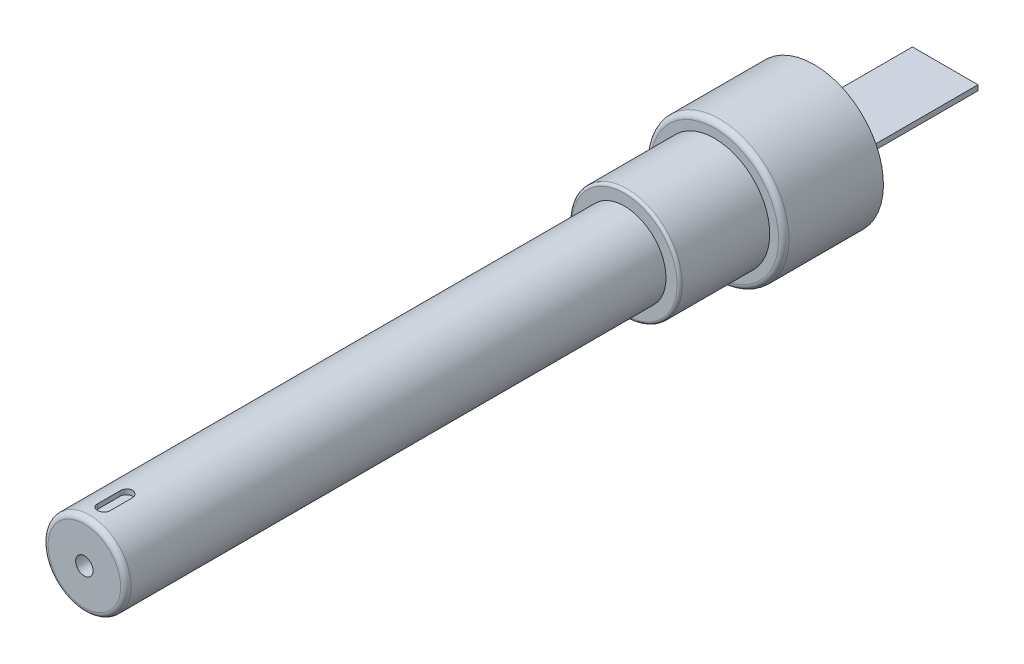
from build123d import *

# Parameters (mm, degrees)
ISFET_DEPTH = 0.762
SKETCH6_W   = 9.525
SKETCH6_H   = 0.762
PCB_DEPTH   = 25.4


with BuildPart() as part:
    # Sketch1 → sensor body (revolve)
    with BuildSketch(Plane(origin=(0, 0, 0), x_dir=(0, 0, -1), z_dir=(1, 0, 0)), mode=Mode.PRIVATE) as sensor_body_sk:
        with BuildLine():
            Line((0, 1.27), (9.525, 1.27))
            Line((9.525, 1.27), (9.525, 5.5245))
            Line((9.525, 5.5245), (78.486, 5.5245))
            Line((78.486, 5.5245), (78.486, 6.0325))
            Line((78.486, 6.0325), (0.762, 6.0325))
            ThreePointArc((0.762, 6.0325), (0.223184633, 5.809315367), (0, 5.2705))
            Line((0, 5.2705), (0, 1.27))
        make_face()
    revolve(sensor_body_sk.sketch.rotate(Axis((0, 0, 0), (0, 0, -1)), 90), axis=Axis((0, 0, 0), (0, 0, -1)))

    # Sketch2 → isfet (cut)
    with BuildSketch(Plane(origin=(0, 6.0325, 0), x_dir=(1, 0, 0), z_dir=(0, 1, 0))):
        with BuildLine():
            Line((-0.889, 2.794), (-0.889, 6.096))
            ThreePointArc((-0.889, 6.096), (0, 6.985), (0.889, 6.096))
            Line((0.889, 6.096), (0.889, 2.794))
            ThreePointArc((0.889, 2.794), (0, 1.905), (-0.889, 2.794))
        make_face()
    extrude(amount=-ISFET_DEPTH, mode=Mode.SUBTRACT)

    # Sketch5 → base (revolve)
    with BuildSketch(Plane(origin=(0, 0, 0), x_dir=(0, 0, -1), z_dir=(1, 0, 0))):
        with BuildLine():
            Line((91.567, 8.0264), (91.567, 9.3091))
            ThreePointArc((91.567, 9.3091), (91.790184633, 9.847915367), (92.329, 10.0711))
            Line((92.329, 10.0711), (106.045, 10.0711))
            Line((106.045, 10.0711), (106.045, 8.8011))
            Line((106.045, 8.8011), (99.695, 8.8011))
            Line((99.695, 8.8011), (99.695, 0))
            Line((99.695, 0), (90.600077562, 0))
            Line((90.600077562, 0), (78.486, 0))
            Line((78.486, 0), (78.486, 7.6454))
            ThreePointArc((78.486, 7.6454), (78.597592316, 7.914807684), (78.867, 8.0264))
            Line((78.867, 8.0264), (91.567, 8.0264))
        make_face()
    revolve(axis=Axis((0, 0, -116.808391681), (0, 0, 1)))

    # Sketch6 → pcb (add)
    with BuildSketch(Plane(origin=(0, 0, -99.695), x_dir=(-1, 0, 0), z_dir=(0, 0, -1))):
        Rectangle(SKETCH6_W, SKETCH6_H)
    extrude(amount=PCB_DEPTH)


solid = part.part
